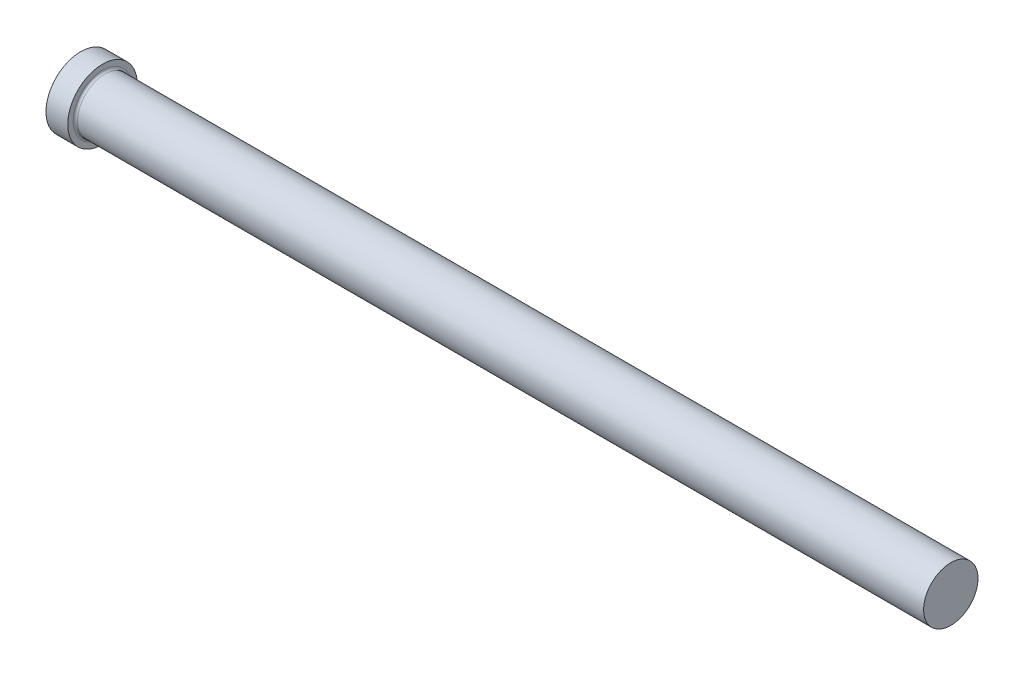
ISO-10303-21;
HEADER;
FILE_DESCRIPTION(('STEP AP214'),'2;1');
FILE_NAME('part.step','',(''),(''),'','','');
FILE_SCHEMA(('AUTOMOTIVE_DESIGN { 1 0 10303 214 1 1 1 1 }'));
ENDSEC;
DATA;
#1=APPLICATION_CONTEXT('core data for automotive mechanical design processes');
#2=APPLICATION_PROTOCOL_DEFINITION('international standard','automotive_design',2000,#1);
#3=PRODUCT_CONTEXT('',#1,'mechanical');
#4=PRODUCT('Part','Part','',(#3));
#5=PRODUCT_RELATED_PRODUCT_CATEGORY('part','',(#4));
#6=PRODUCT_DEFINITION_FORMATION('','',#4);
#7=PRODUCT_DEFINITION_CONTEXT('part definition',#1,'design');
#8=PRODUCT_DEFINITION('design','',#6,#7);
#9=PRODUCT_DEFINITION_SHAPE('','',#8);
#10=(LENGTH_UNIT() NAMED_UNIT(*) SI_UNIT(.MILLI.,.METRE.));
#11=(NAMED_UNIT(*) PLANE_ANGLE_UNIT() SI_UNIT($,.RADIAN.));
#12=(NAMED_UNIT(*) SI_UNIT($,.STERADIAN.) SOLID_ANGLE_UNIT());
#13=UNCERTAINTY_MEASURE_WITH_UNIT(LENGTH_MEASURE(1.E-05),#10,'distance_accuracy_value','');
#14=(GEOMETRIC_REPRESENTATION_CONTEXT(3) GLOBAL_UNCERTAINTY_ASSIGNED_CONTEXT((#13)) GLOBAL_UNIT_ASSIGNED_CONTEXT((#10,
#11,#12)) REPRESENTATION_CONTEXT('',''));
#15=CARTESIAN_POINT('',(0.,0.,0.));
#16=DIRECTION('',(0.,0.,1.));
#17=DIRECTION('',(1.,0.,0.));
#18=AXIS2_PLACEMENT_3D('',#15,#16,#17);
#19=CARTESIAN_POINT('',(0.,0.,0.));
#20=DIRECTION('',(-1.,0.,0.));
#21=DIRECTION('',(0.,-1.,0.));
#22=AXIS2_PLACEMENT_3D('',#19,#20,#21);
#23=PLANE('',#22);
#24=CARTESIAN_POINT('',(0.,0.,0.));
#25=DIRECTION('',(1.,0.,0.));
#26=DIRECTION('',(0.,1.,0.));
#27=AXIS2_PLACEMENT_3D('',#24,#25,#26);
#28=CIRCLE('',#27,16.);
#29=CARTESIAN_POINT('',(0.,16.,0.));
#30=VERTEX_POINT('',#29);
#31=EDGE_CURVE('E25',#30,#30,#28,.T.);
#32=ORIENTED_EDGE('',*,*,#31,.F.);
#33=EDGE_LOOP('',(#32));
#34=FACE_BOUND('',#33,.T.);
#35=ADVANCED_FACE('F14',(#34),#23,.T.);
#36=CARTESIAN_POINT('',(400.,0.,0.));
#37=DIRECTION('',(1.,0.,0.));
#38=DIRECTION('',(0.,1.,0.));
#39=AXIS2_PLACEMENT_3D('',#36,#37,#38);
#40=CYLINDRICAL_SURFACE('',#39,16.);
#41=ORIENTED_EDGE('',*,*,#31,.T.);
#42=EDGE_LOOP('',(#41));
#43=FACE_BOUND('',#42,.T.);
#44=CARTESIAN_POINT('',(10.,0.,0.));
#45=DIRECTION('',(1.,0.,0.));
#46=DIRECTION('',(0.,1.,0.));
#47=AXIS2_PLACEMENT_3D('',#44,#45,#46);
#48=CIRCLE('',#47,16.);
#49=CARTESIAN_POINT('',(10.,16.,0.));
#50=VERTEX_POINT('',#49);
#51=EDGE_CURVE('E29',#50,#50,#48,.T.);
#52=ORIENTED_EDGE('',*,*,#51,.F.);
#53=EDGE_LOOP('',(#52));
#54=FACE_BOUND('',#53,.T.);
#55=ADVANCED_FACE('F51',(#43,#54),#40,.T.);
#56=CARTESIAN_POINT('',(10.,16.,0.));
#57=DIRECTION('',(1.,0.,0.));
#58=DIRECTION('',(0.,1.,0.));
#59=AXIS2_PLACEMENT_3D('',#56,#57,#58);
#60=PLANE('',#59);
#61=CARTESIAN_POINT('',(10.,0.,0.));
#62=DIRECTION('',(1.,0.,0.));
#63=DIRECTION('',(0.,1.,0.));
#64=AXIS2_PLACEMENT_3D('',#61,#62,#63);
#65=CIRCLE('',#64,13.5);
#66=CARTESIAN_POINT('',(10.,13.5,0.));
#67=VERTEX_POINT('',#66);
#68=EDGE_CURVE('E9',#67,#67,#65,.F.);
#69=ORIENTED_EDGE('',*,*,#68,.T.);
#70=EDGE_LOOP('',(#69));
#71=FACE_BOUND('',#70,.T.);
#72=ORIENTED_EDGE('',*,*,#51,.T.);
#73=EDGE_LOOP('',(#72));
#74=FACE_BOUND('',#73,.T.);
#75=ADVANCED_FACE('F42',(#71,#74),#60,.T.);
#76=CARTESIAN_POINT('',(400.,0.,0.));
#77=DIRECTION('',(1.,0.,0.));
#78=DIRECTION('',(0.,1.,0.));
#79=AXIS2_PLACEMENT_3D('',#76,#77,#78);
#80=CYLINDRICAL_SURFACE('',#79,12.5);
#81=CARTESIAN_POINT('',(11.,0.,0.));
#82=DIRECTION('',(1.,0.,0.));
#83=DIRECTION('',(0.,1.,0.));
#84=AXIS2_PLACEMENT_3D('',#81,#82,#83);
#85=CIRCLE('',#84,12.5);
#86=CARTESIAN_POINT('',(11.,12.5,0.));
#87=VERTEX_POINT('',#86);
#88=EDGE_CURVE('E21',#87,#87,#85,.T.);
#89=ORIENTED_EDGE('',*,*,#88,.T.);
#90=EDGE_LOOP('',(#89));
#91=FACE_BOUND('',#90,.T.);
#92=CARTESIAN_POINT('',(400.,0.,0.));
#93=DIRECTION('',(1.,0.,0.));
#94=DIRECTION('',(0.,1.,0.));
#95=AXIS2_PLACEMENT_3D('',#92,#93,#94);
#96=CIRCLE('',#95,12.5);
#97=CARTESIAN_POINT('',(400.,12.5,0.));
#98=VERTEX_POINT('',#97);
#99=EDGE_CURVE('E34',#98,#98,#96,.T.);
#100=ORIENTED_EDGE('',*,*,#99,.F.);
#101=EDGE_LOOP('',(#100));
#102=FACE_BOUND('',#101,.T.);
#103=ADVANCED_FACE('F40',(#91,#102),#80,.T.);
#104=CARTESIAN_POINT('',(400.,12.5,0.));
#105=DIRECTION('',(1.,0.,0.));
#106=DIRECTION('',(0.,1.,0.));
#107=AXIS2_PLACEMENT_3D('',#104,#105,#106);
#108=PLANE('',#107);
#109=ORIENTED_EDGE('',*,*,#99,.T.);
#110=EDGE_LOOP('',(#109));
#111=FACE_BOUND('',#110,.T.);
#112=ADVANCED_FACE('F38',(#111),#108,.T.);
#113=CARTESIAN_POINT('',(11.,0.,0.));
#114=DIRECTION('',(1.,0.,0.));
#115=DIRECTION('',(0.,1.,0.));
#116=AXIS2_PLACEMENT_3D('',#113,#114,#115);
#117=TOROIDAL_SURFACE('',#116,13.5,1.);
#118=ORIENTED_EDGE('',*,*,#68,.F.);
#119=EDGE_LOOP('',(#118));
#120=FACE_BOUND('',#119,.T.);
#121=ORIENTED_EDGE('',*,*,#88,.F.);
#122=EDGE_LOOP('',(#121));
#123=FACE_BOUND('',#122,.T.);
#124=ADVANCED_FACE('F16',(#120,#123),#117,.F.);
#125=CLOSED_SHELL('',(#35,#55,#75,#103,#112,#124));
#126=MANIFOLD_SOLID_BREP('B1',#125);
#127=ADVANCED_BREP_SHAPE_REPRESENTATION('',(#18,#126),#14);
#128=SHAPE_DEFINITION_REPRESENTATION(#9,#127);
ENDSEC;
END-ISO-10303-21;
